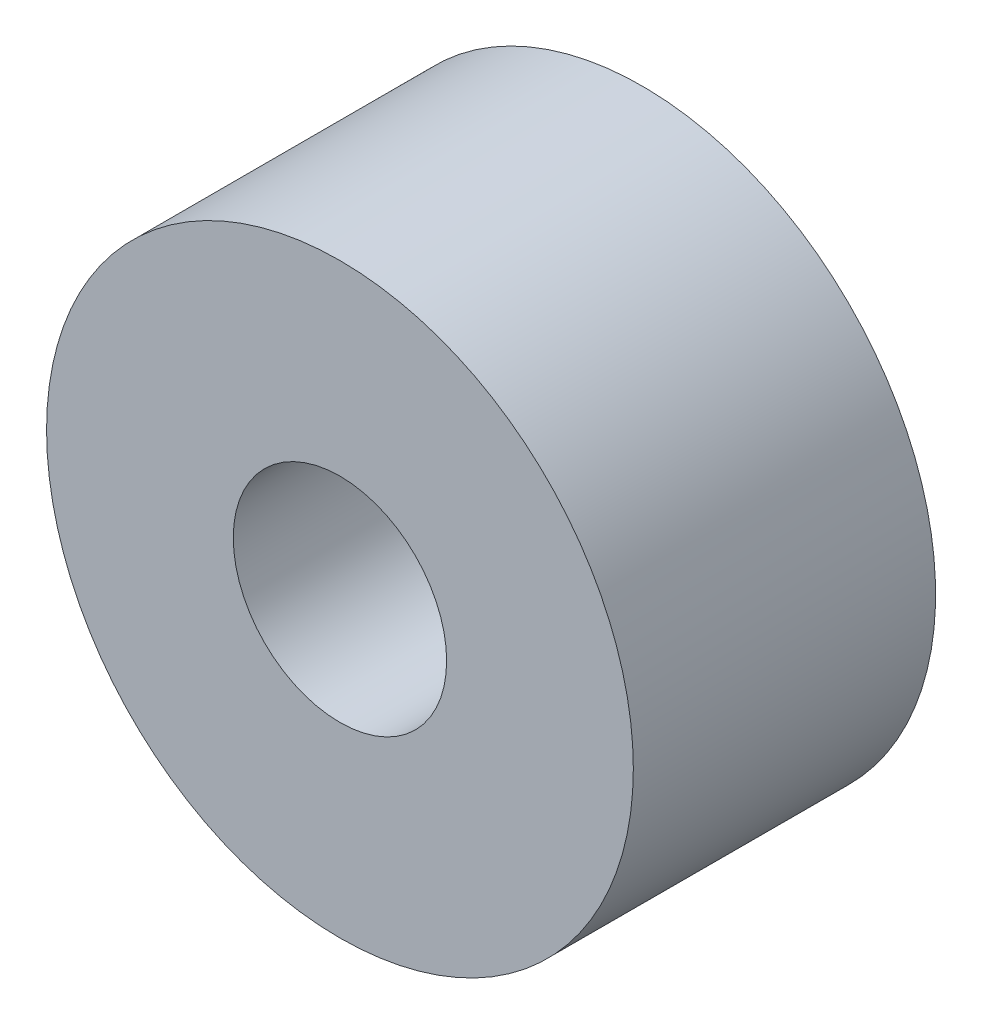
from build123d import *

# Parameters (mm, degrees)
ESQUISSE1_R             = 16.5
ESQUISSE1_R_2           = 6
EXTRUSION1_DEPTH        = 165
ESQUISSE2_R             = 16.5
ENL_V_MAT_EXTRU_1_DEPTH = 148


with BuildPart() as part:
    # Esquisse1 → Extrusion1 (new body)
    with BuildSketch(Plane.XY):
        with Locations((360, -290)):
            Circle(ESQUISSE1_R)
        with Locations((360, -290)):
            Circle(ESQUISSE1_R_2, mode=Mode.SUBTRACT)
    extrude(amount=EXTRUSION1_DEPTH)

    # Esquisse2 → Enl_v. mat.-Extru.1 (cut)
    with BuildSketch(Plane(origin=(0, 0, 0), x_dir=(-1, 0, 0), z_dir=(0, 0, -1))):
        with Locations((-360, -290)):
            Circle(ESQUISSE2_R)
    extrude(amount=-ENL_V_MAT_EXTRU_1_DEPTH, mode=Mode.SUBTRACT)


solid = part.part
